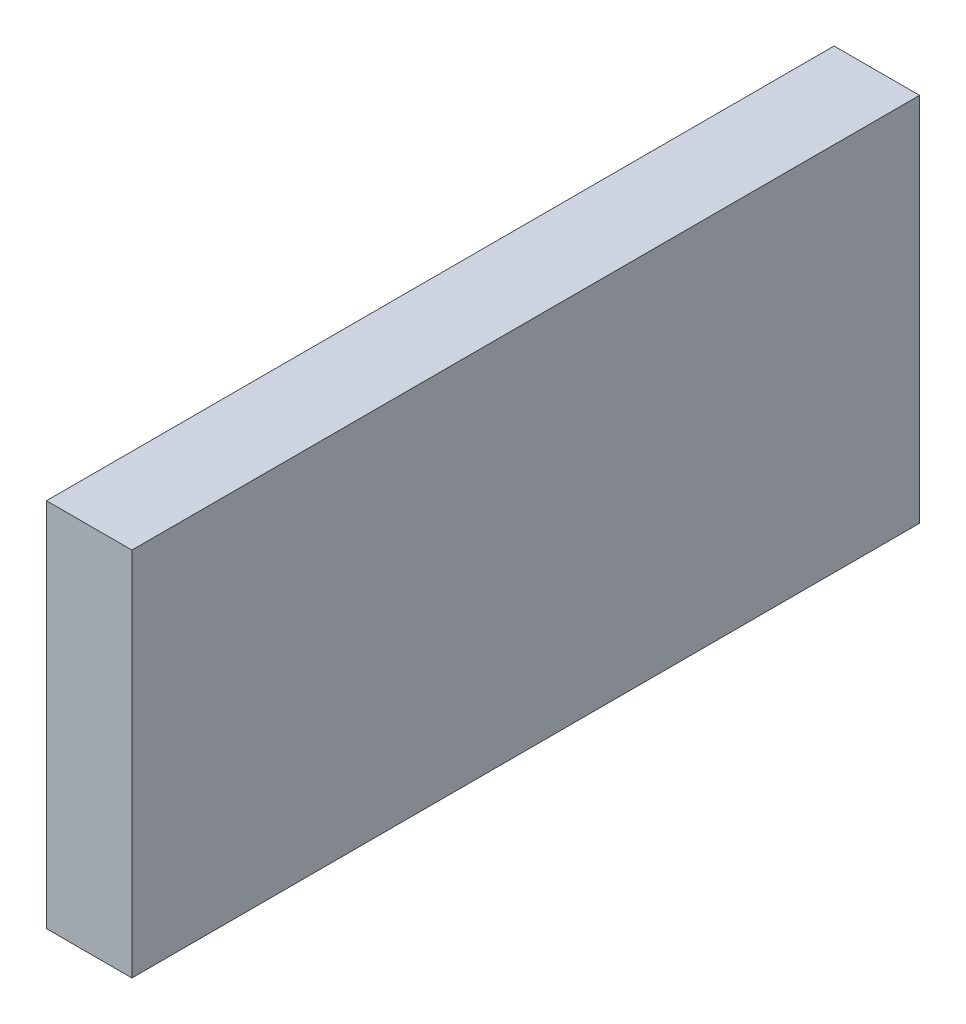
from build123d import *

# Parameters (mm, degrees)
SKETCH1_W           = 5.5118
SKETCH1_H           = 23.9014
BOSS_EXTRUDE1_DEPTH = 50.8


with BuildPart() as part:
    # Sketch1 → Boss-Extrude1 (new body)
    with BuildSketch(Plane.XY):
        with Locations((2.7559, -11.9507)):
            Rectangle(SKETCH1_W, SKETCH1_H)
    extrude(amount=-BOSS_EXTRUDE1_DEPTH)


solid = part.part
